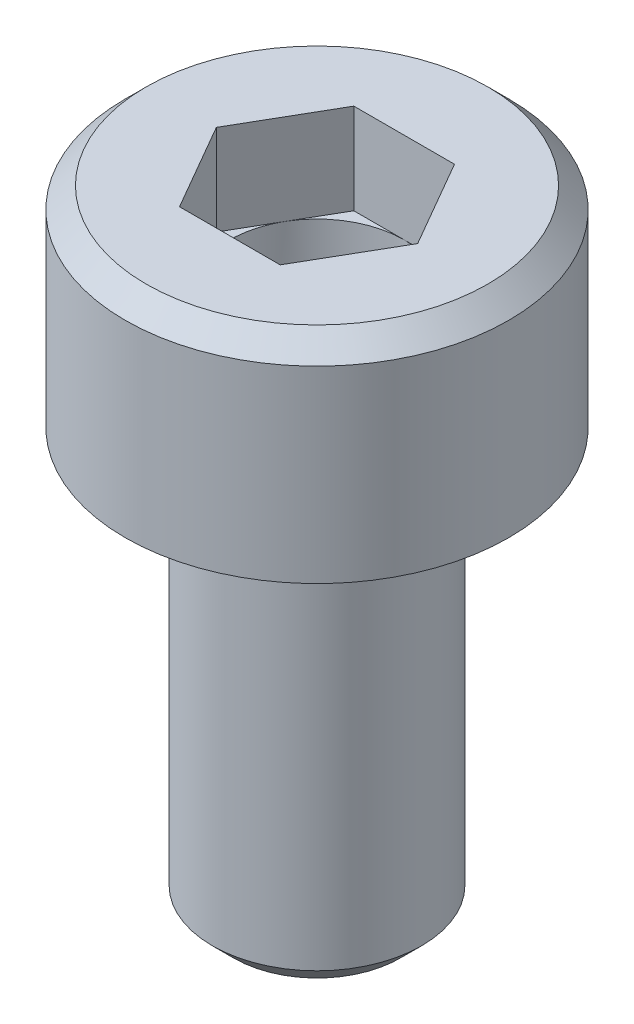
ISO-10303-21;
HEADER;
FILE_DESCRIPTION(('STEP AP214'),'2;1');
FILE_NAME('part.step','',(''),(''),'','','');
FILE_SCHEMA(('AUTOMOTIVE_DESIGN { 1 0 10303 214 1 1 1 1 }'));
ENDSEC;
DATA;
#1=APPLICATION_CONTEXT('core data for automotive mechanical design processes');
#2=APPLICATION_PROTOCOL_DEFINITION('international standard','automotive_design',2000,#1);
#3=PRODUCT_CONTEXT('',#1,'mechanical');
#4=PRODUCT('Part','Part','',(#3));
#5=PRODUCT_RELATED_PRODUCT_CATEGORY('part','',(#4));
#6=PRODUCT_DEFINITION_FORMATION('','',#4);
#7=PRODUCT_DEFINITION_CONTEXT('part definition',#1,'design');
#8=PRODUCT_DEFINITION('design','',#6,#7);
#9=PRODUCT_DEFINITION_SHAPE('','',#8);
#10=(LENGTH_UNIT() NAMED_UNIT(*) SI_UNIT(.MILLI.,.METRE.));
#11=(NAMED_UNIT(*) PLANE_ANGLE_UNIT() SI_UNIT($,.RADIAN.));
#12=(NAMED_UNIT(*) SI_UNIT($,.STERADIAN.) SOLID_ANGLE_UNIT());
#13=UNCERTAINTY_MEASURE_WITH_UNIT(LENGTH_MEASURE(1.E-05),#10,'distance_accuracy_value','');
#14=(GEOMETRIC_REPRESENTATION_CONTEXT(3) GLOBAL_UNCERTAINTY_ASSIGNED_CONTEXT((#13)) GLOBAL_UNIT_ASSIGNED_CONTEXT((#10,
#11,#12)) REPRESENTATION_CONTEXT('',''));
#15=CARTESIAN_POINT('',(0.,0.,0.));
#16=DIRECTION('',(0.,0.,1.));
#17=DIRECTION('',(1.,0.,0.));
#18=AXIS2_PLACEMENT_3D('',#15,#16,#17);
#19=CARTESIAN_POINT('',(0.,1.14999999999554,0.));
#20=DIRECTION('',(0.,1.,0.));
#21=DIRECTION('',(0.,0.,1.));
#22=AXIS2_PLACEMENT_3D('',#19,#20,#21);
#23=CONICAL_SURFACE('',#22,1.25000000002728,1.04719755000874);
#24=CARTESIAN_POINT('',(0.,0.428312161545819,-5.6843418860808E-11));
#25=VERTEX_POINT('',#24);
#26=VERTEX_LOOP('',#25);
#27=FACE_BOUND('',#26,.T.);
#28=CARTESIAN_POINT('',(0.,1.15,0.));
#29=DIRECTION('',(0.,-1.,0.));
#30=DIRECTION('',(0.,0.,-1.));
#31=AXIS2_PLACEMENT_3D('',#28,#29,#30);
#32=CIRCLE('',#31,1.25);
#33=CARTESIAN_POINT('',(0.,1.15,-1.25));
#34=VERTEX_POINT('',#33);
#35=EDGE_CURVE('E99',#34,#34,#32,.F.);
#36=ORIENTED_EDGE('',*,*,#35,.T.);
#37=EDGE_LOOP('',(#36));
#38=FACE_BOUND('',#37,.T.);
#39=ADVANCED_FACE('F17',(#27,#38),#23,.F.);
#40=CARTESIAN_POINT('',(0.,3.,0.));
#41=DIRECTION('',(0.,-1.,0.));
#42=DIRECTION('',(0.,0.,-1.));
#43=AXIS2_PLACEMENT_3D('',#40,#41,#42);
#44=CYLINDRICAL_SURFACE('',#43,1.25);
#45=CARTESIAN_POINT('',(0.,1.7,0.));
#46=DIRECTION('',(0.,-1.,0.));
#47=DIRECTION('',(0.,0.,-1.));
#48=AXIS2_PLACEMENT_3D('',#45,#46,#47);
#49=CIRCLE('',#48,1.25);
#50=CARTESIAN_POINT('',(0.,1.7,-1.25));
#51=VERTEX_POINT('',#50);
#52=CARTESIAN_POINT('',(-1.08253175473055,1.7,-0.625));
#53=VERTEX_POINT('',#52);
#54=EDGE_CURVE('E20',#51,#53,#49,.F.);
#55=ORIENTED_EDGE('',*,*,#54,.T.);
#56=CARTESIAN_POINT('',(0.,1.7,0.));
#57=DIRECTION('',(0.,-1.,0.));
#58=DIRECTION('',(0.,0.,-1.));
#59=AXIS2_PLACEMENT_3D('',#56,#57,#58);
#60=CIRCLE('',#59,1.25);
#61=CARTESIAN_POINT('',(-1.08253175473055,1.7,0.625));
#62=VERTEX_POINT('',#61);
#63=EDGE_CURVE('E94',#53,#62,#60,.F.);
#64=ORIENTED_EDGE('',*,*,#63,.T.);
#65=CARTESIAN_POINT('',(0.,1.7,0.));
#66=DIRECTION('',(0.,-1.,0.));
#67=DIRECTION('',(0.,0.,-1.));
#68=AXIS2_PLACEMENT_3D('',#65,#66,#67);
#69=CIRCLE('',#68,1.25);
#70=CARTESIAN_POINT('',(0.,1.7,1.25));
#71=VERTEX_POINT('',#70);
#72=EDGE_CURVE('E109',#62,#71,#69,.F.);
#73=ORIENTED_EDGE('',*,*,#72,.T.);
#74=CARTESIAN_POINT('',(0.,1.7,0.));
#75=DIRECTION('',(0.,-1.,0.));
#76=DIRECTION('',(0.,0.,-1.));
#77=AXIS2_PLACEMENT_3D('',#74,#75,#76);
#78=CIRCLE('',#77,1.25);
#79=CARTESIAN_POINT('',(1.08253175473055,1.7,0.625));
#80=VERTEX_POINT('',#79);
#81=EDGE_CURVE('E218',#71,#80,#78,.F.);
#82=ORIENTED_EDGE('',*,*,#81,.T.);
#83=CARTESIAN_POINT('',(0.,1.7,0.));
#84=DIRECTION('',(0.,-1.,0.));
#85=DIRECTION('',(0.,0.,-1.));
#86=AXIS2_PLACEMENT_3D('',#83,#84,#85);
#87=CIRCLE('',#86,1.25);
#88=CARTESIAN_POINT('',(1.08253175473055,1.7,-0.625));
#89=VERTEX_POINT('',#88);
#90=EDGE_CURVE('E220',#80,#89,#87,.F.);
#91=ORIENTED_EDGE('',*,*,#90,.T.);
#92=CARTESIAN_POINT('',(0.,1.7,0.));
#93=DIRECTION('',(0.,-1.,0.));
#94=DIRECTION('',(0.,0.,-1.));
#95=AXIS2_PLACEMENT_3D('',#92,#93,#94);
#96=CIRCLE('',#95,1.25);
#97=EDGE_CURVE('E89',#89,#51,#96,.F.);
#98=ORIENTED_EDGE('',*,*,#97,.T.);
#99=EDGE_LOOP('',(#55,#64,#73,#82,#91,#98));
#100=FACE_BOUND('',#99,.T.);
#101=ORIENTED_EDGE('',*,*,#35,.F.);
#102=EDGE_LOOP('',(#101));
#103=FACE_BOUND('',#102,.T.);
#104=ADVANCED_FACE('F92',(#100,#103),#44,.F.);
#105=CARTESIAN_POINT('',(0.,1.7,0.));
#106=DIRECTION('',(0.,-1.,0.));
#107=DIRECTION('',(0.,0.,-1.));
#108=AXIS2_PLACEMENT_3D('',#105,#106,#107);
#109=PLANE('',#108);
#110=DIRECTION('',(-0.5,0.,0.866025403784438));
#111=VECTOR('',#110,1.);
#112=CARTESIAN_POINT('',(-1.08253175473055,1.7,-0.625));
#113=LINE('',#112,#111);
#114=CARTESIAN_POINT('',(-0.721687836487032,1.7,-1.25));
#115=VERTEX_POINT('',#114);
#116=EDGE_CURVE('E112',#115,#53,#113,.T.);
#117=ORIENTED_EDGE('',*,*,#116,.T.);
#118=ORIENTED_EDGE('',*,*,#54,.F.);
#119=DIRECTION('',(-1.,0.,0.));
#120=VECTOR('',#119,1.);
#121=CARTESIAN_POINT('',(0.,1.7,-1.25));
#122=LINE('',#121,#120);
#123=EDGE_CURVE('E115',#51,#115,#122,.T.);
#124=ORIENTED_EDGE('',*,*,#123,.T.);
#125=EDGE_LOOP('',(#117,#118,#124));
#126=FACE_BOUND('',#125,.T.);
#127=ADVANCED_FACE('F113',(#126),#109,.F.);
#128=CARTESIAN_POINT('',(0.,1.7,0.));
#129=DIRECTION('',(0.,-1.,0.));
#130=DIRECTION('',(0.,0.,-1.));
#131=AXIS2_PLACEMENT_3D('',#128,#129,#130);
#132=PLANE('',#131);
#133=DIRECTION('',(-1.,0.,0.));
#134=VECTOR('',#133,1.);
#135=CARTESIAN_POINT('',(0.,1.7,-1.25));
#136=LINE('',#135,#134);
#137=CARTESIAN_POINT('',(0.721687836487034,1.7,-1.25));
#138=VERTEX_POINT('',#137);
#139=EDGE_CURVE('E184',#138,#51,#136,.T.);
#140=ORIENTED_EDGE('',*,*,#139,.T.);
#141=ORIENTED_EDGE('',*,*,#97,.F.);
#142=DIRECTION('',(0.5,0.,0.866025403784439));
#143=VECTOR('',#142,1.);
#144=CARTESIAN_POINT('',(1.08253175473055,1.7,-0.625));
#145=LINE('',#144,#143);
#146=EDGE_CURVE('E175',#138,#89,#145,.T.);
#147=ORIENTED_EDGE('',*,*,#146,.F.);
#148=EDGE_LOOP('',(#140,#141,#147));
#149=FACE_BOUND('',#148,.T.);
#150=ADVANCED_FACE('F227',(#149),#132,.F.);
#151=CARTESIAN_POINT('',(0.,1.7,0.));
#152=DIRECTION('',(0.,-1.,0.));
#153=DIRECTION('',(0.,0.,-1.));
#154=AXIS2_PLACEMENT_3D('',#151,#152,#153);
#155=PLANE('',#154);
#156=DIRECTION('',(0.5,0.,0.866025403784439));
#157=VECTOR('',#156,1.);
#158=CARTESIAN_POINT('',(1.08253175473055,1.7,-0.625));
#159=LINE('',#158,#157);
#160=CARTESIAN_POINT('',(1.44337567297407,1.7,0.));
#161=VERTEX_POINT('',#160);
#162=EDGE_CURVE('E172',#89,#161,#159,.T.);
#163=ORIENTED_EDGE('',*,*,#162,.F.);
#164=ORIENTED_EDGE('',*,*,#90,.F.);
#165=DIRECTION('',(-0.5,0.,0.866025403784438));
#166=VECTOR('',#165,1.);
#167=CARTESIAN_POINT('',(1.08253175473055,1.7,0.625));
#168=LINE('',#167,#166);
#169=EDGE_CURVE('E160',#161,#80,#168,.T.);
#170=ORIENTED_EDGE('',*,*,#169,.F.);
#171=EDGE_LOOP('',(#163,#164,#170));
#172=FACE_BOUND('',#171,.T.);
#173=ADVANCED_FACE('F229',(#172),#155,.F.);
#174=CARTESIAN_POINT('',(0.,1.7,0.));
#175=DIRECTION('',(0.,-1.,0.));
#176=DIRECTION('',(0.,0.,-1.));
#177=AXIS2_PLACEMENT_3D('',#174,#175,#176);
#178=PLANE('',#177);
#179=DIRECTION('',(-0.5,0.,0.866025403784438));
#180=VECTOR('',#179,1.);
#181=CARTESIAN_POINT('',(1.08253175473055,1.7,0.625));
#182=LINE('',#181,#180);
#183=CARTESIAN_POINT('',(0.721687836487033,1.7,1.25));
#184=VERTEX_POINT('',#183);
#185=EDGE_CURVE('E157',#80,#184,#182,.T.);
#186=ORIENTED_EDGE('',*,*,#185,.F.);
#187=ORIENTED_EDGE('',*,*,#81,.F.);
#188=DIRECTION('',(-1.,0.,0.));
#189=VECTOR('',#188,1.);
#190=CARTESIAN_POINT('',(0.,1.7,1.25));
#191=LINE('',#190,#189);
#192=EDGE_CURVE('E145',#184,#71,#191,.T.);
#193=ORIENTED_EDGE('',*,*,#192,.F.);
#194=EDGE_LOOP('',(#186,#187,#193));
#195=FACE_BOUND('',#194,.T.);
#196=ADVANCED_FACE('F266',(#195),#178,.F.);
#197=CARTESIAN_POINT('',(0.,1.7,0.));
#198=DIRECTION('',(0.,-1.,0.));
#199=DIRECTION('',(0.,0.,-1.));
#200=AXIS2_PLACEMENT_3D('',#197,#198,#199);
#201=PLANE('',#200);
#202=DIRECTION('',(-1.,0.,0.));
#203=VECTOR('',#202,1.);
#204=CARTESIAN_POINT('',(0.,1.7,1.25));
#205=LINE('',#204,#203);
#206=CARTESIAN_POINT('',(-0.721687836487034,1.7,1.25));
#207=VERTEX_POINT('',#206);
#208=EDGE_CURVE('E142',#71,#207,#205,.T.);
#209=ORIENTED_EDGE('',*,*,#208,.F.);
#210=ORIENTED_EDGE('',*,*,#72,.F.);
#211=DIRECTION('',(0.5,0.,0.866025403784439));
#212=VECTOR('',#211,1.);
#213=CARTESIAN_POINT('',(-1.08253175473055,1.7,0.625));
#214=LINE('',#213,#212);
#215=EDGE_CURVE('E149',#62,#207,#214,.T.);
#216=ORIENTED_EDGE('',*,*,#215,.T.);
#217=EDGE_LOOP('',(#209,#210,#216));
#218=FACE_BOUND('',#217,.T.);
#219=ADVANCED_FACE('F263',(#218),#201,.F.);
#220=CARTESIAN_POINT('',(0.,1.7,0.));
#221=DIRECTION('',(0.,-1.,0.));
#222=DIRECTION('',(0.,0.,-1.));
#223=AXIS2_PLACEMENT_3D('',#220,#221,#222);
#224=PLANE('',#223);
#225=DIRECTION('',(0.5,0.,0.866025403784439));
#226=VECTOR('',#225,1.);
#227=CARTESIAN_POINT('',(-1.08253175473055,1.7,0.625));
#228=LINE('',#227,#226);
#229=CARTESIAN_POINT('',(-1.44337567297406,1.7,0.));
#230=VERTEX_POINT('',#229);
#231=EDGE_CURVE('E107',#230,#62,#228,.T.);
#232=ORIENTED_EDGE('',*,*,#231,.T.);
#233=ORIENTED_EDGE('',*,*,#63,.F.);
#234=DIRECTION('',(-0.5,0.,0.866025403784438));
#235=VECTOR('',#234,1.);
#236=CARTESIAN_POINT('',(-1.08253175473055,1.7,-0.625));
#237=LINE('',#236,#235);
#238=EDGE_CURVE('E104',#53,#230,#237,.T.);
#239=ORIENTED_EDGE('',*,*,#238,.T.);
#240=EDGE_LOOP('',(#232,#233,#239));
#241=FACE_BOUND('',#240,.T.);
#242=ADVANCED_FACE('F102',(#241),#224,.F.);
#243=CARTESIAN_POINT('',(-1.08253175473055,2.5,-0.625));
#244=DIRECTION('',(-0.866025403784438,0.,-0.5));
#245=DIRECTION('',(-0.5,0.,0.866025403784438));
#246=AXIS2_PLACEMENT_3D('',#243,#244,#245);
#247=PLANE('',#246);
#248=DIRECTION('',(0.,1.,0.));
#249=VECTOR('',#248,1.);
#250=CARTESIAN_POINT('',(-0.721687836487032,3.,-1.25));
#251=LINE('',#250,#249);
#252=CARTESIAN_POINT('',(-0.721687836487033,3.,-1.25));
#253=VERTEX_POINT('',#252);
#254=EDGE_CURVE('E188',#115,#253,#251,.T.);
#255=ORIENTED_EDGE('',*,*,#254,.T.);
#256=DIRECTION('',(0.499999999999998,0.,-0.86602540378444));
#257=VECTOR('',#256,1.);
#258=CARTESIAN_POINT('',(-1.44337567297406,3.,0.));
#259=LINE('',#258,#257);
#260=CARTESIAN_POINT('',(-1.44337567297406,3.,0.));
#261=VERTEX_POINT('',#260);
#262=EDGE_CURVE('E129',#261,#253,#259,.T.);
#263=ORIENTED_EDGE('',*,*,#262,.F.);
#264=DIRECTION('',(0.,1.,0.));
#265=VECTOR('',#264,1.);
#266=CARTESIAN_POINT('',(-1.44337567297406,2.5,0.));
#267=LINE('',#266,#265);
#268=EDGE_CURVE('E121',#261,#230,#267,.F.);
#269=ORIENTED_EDGE('',*,*,#268,.T.);
#270=ORIENTED_EDGE('',*,*,#238,.F.);
#271=ORIENTED_EDGE('',*,*,#116,.F.);
#272=EDGE_LOOP('',(#255,#263,#269,#270,#271));
#273=FACE_BOUND('',#272,.T.);
#274=ADVANCED_FACE('F119',(#273),#247,.F.);
#275=CARTESIAN_POINT('',(0.,3.,-1.25));
#276=DIRECTION('',(0.,0.,-1.));
#277=DIRECTION('',(-1.,0.,0.));
#278=AXIS2_PLACEMENT_3D('',#275,#276,#277);
#279=PLANE('',#278);
#280=DIRECTION('',(0.,1.,0.));
#281=VECTOR('',#280,1.);
#282=CARTESIAN_POINT('',(0.721687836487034,2.5,-1.25));
#283=LINE('',#282,#281);
#284=CARTESIAN_POINT('',(0.721687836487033,3.,-1.25));
#285=VERTEX_POINT('',#284);
#286=EDGE_CURVE('E169',#285,#138,#283,.F.);
#287=ORIENTED_EDGE('',*,*,#286,.F.);
#288=DIRECTION('',(1.,0.,0.));
#289=VECTOR('',#288,1.);
#290=CARTESIAN_POINT('',(0.,3.,-1.25));
#291=LINE('',#290,#289);
#292=EDGE_CURVE('E132',#253,#285,#291,.T.);
#293=ORIENTED_EDGE('',*,*,#292,.F.);
#294=ORIENTED_EDGE('',*,*,#254,.F.);
#295=ORIENTED_EDGE('',*,*,#123,.F.);
#296=ORIENTED_EDGE('',*,*,#139,.F.);
#297=EDGE_LOOP('',(#287,#293,#294,#295,#296));
#298=FACE_BOUND('',#297,.T.);
#299=ADVANCED_FACE('F238',(#298),#279,.F.);
#300=CARTESIAN_POINT('',(1.08253175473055,2.5,-0.625));
#301=DIRECTION('',(-0.866025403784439,0.,0.5));
#302=DIRECTION('',(0.5,0.,0.866025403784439));
#303=AXIS2_PLACEMENT_3D('',#300,#301,#302);
#304=PLANE('',#303);
#305=DIRECTION('',(0.499999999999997,0.,0.86602540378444));
#306=VECTOR('',#305,1.);
#307=CARTESIAN_POINT('',(0.721687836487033,3.,-1.25));
#308=LINE('',#307,#306);
#309=CARTESIAN_POINT('',(1.44337567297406,3.,0.));
#310=VERTEX_POINT('',#309);
#311=EDGE_CURVE('E234',#285,#310,#308,.T.);
#312=ORIENTED_EDGE('',*,*,#311,.F.);
#313=ORIENTED_EDGE('',*,*,#286,.T.);
#314=ORIENTED_EDGE('',*,*,#146,.T.);
#315=ORIENTED_EDGE('',*,*,#162,.T.);
#316=DIRECTION('',(0.,1.,0.));
#317=VECTOR('',#316,1.);
#318=CARTESIAN_POINT('',(1.44337567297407,2.5,0.));
#319=LINE('',#318,#317);
#320=EDGE_CURVE('E154',#310,#161,#319,.F.);
#321=ORIENTED_EDGE('',*,*,#320,.F.);
#322=EDGE_LOOP('',(#312,#313,#314,#315,#321));
#323=FACE_BOUND('',#322,.T.);
#324=ADVANCED_FACE('F232',(#323),#304,.T.);
#325=CARTESIAN_POINT('',(1.08253175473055,2.5,0.625));
#326=DIRECTION('',(-0.866025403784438,0.,-0.5));
#327=DIRECTION('',(-0.5,0.,0.866025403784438));
#328=AXIS2_PLACEMENT_3D('',#325,#326,#327);
#329=PLANE('',#328);
#330=DIRECTION('',(-0.499999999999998,0.,0.86602540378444));
#331=VECTOR('',#330,1.);
#332=CARTESIAN_POINT('',(1.44337567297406,3.,0.));
#333=LINE('',#332,#331);
#334=CARTESIAN_POINT('',(0.721687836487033,3.,1.25));
#335=VERTEX_POINT('',#334);
#336=EDGE_CURVE('E247',#310,#335,#333,.T.);
#337=ORIENTED_EDGE('',*,*,#336,.F.);
#338=ORIENTED_EDGE('',*,*,#320,.T.);
#339=ORIENTED_EDGE('',*,*,#169,.T.);
#340=ORIENTED_EDGE('',*,*,#185,.T.);
#341=DIRECTION('',(0.,1.,0.));
#342=VECTOR('',#341,1.);
#343=CARTESIAN_POINT('',(0.721687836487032,3.,1.25));
#344=LINE('',#343,#342);
#345=EDGE_CURVE('E144',#335,#184,#344,.F.);
#346=ORIENTED_EDGE('',*,*,#345,.F.);
#347=EDGE_LOOP('',(#337,#338,#339,#340,#346));
#348=FACE_BOUND('',#347,.T.);
#349=ADVANCED_FACE('F268',(#348),#329,.T.);
#350=CARTESIAN_POINT('',(0.,3.,1.25));
#351=DIRECTION('',(0.,0.,-1.));
#352=DIRECTION('',(-1.,0.,0.));
#353=AXIS2_PLACEMENT_3D('',#350,#351,#352);
#354=PLANE('',#353);
#355=DIRECTION('',(1.,0.,0.));
#356=VECTOR('',#355,1.);
#357=CARTESIAN_POINT('',(0.,3.,1.25));
#358=LINE('',#357,#356);
#359=CARTESIAN_POINT('',(-0.721687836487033,3.,1.25));
#360=VERTEX_POINT('',#359);
#361=EDGE_CURVE('E139',#335,#360,#358,.F.);
#362=ORIENTED_EDGE('',*,*,#361,.F.);
#363=ORIENTED_EDGE('',*,*,#345,.T.);
#364=ORIENTED_EDGE('',*,*,#192,.T.);
#365=ORIENTED_EDGE('',*,*,#208,.T.);
#366=DIRECTION('',(0.,1.,0.));
#367=VECTOR('',#366,1.);
#368=CARTESIAN_POINT('',(-0.721687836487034,2.5,1.25));
#369=LINE('',#368,#367);
#370=EDGE_CURVE('E35',#207,#360,#369,.T.);
#371=ORIENTED_EDGE('',*,*,#370,.T.);
#372=EDGE_LOOP('',(#362,#363,#364,#365,#371));
#373=FACE_BOUND('',#372,.T.);
#374=ADVANCED_FACE('F264',(#373),#354,.T.);
#375=CARTESIAN_POINT('',(-1.08253175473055,2.5,0.625));
#376=DIRECTION('',(-0.866025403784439,0.,0.5));
#377=DIRECTION('',(0.5,0.,0.866025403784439));
#378=AXIS2_PLACEMENT_3D('',#375,#376,#377);
#379=PLANE('',#378);
#380=ORIENTED_EDGE('',*,*,#268,.F.);
#381=DIRECTION('',(-0.499999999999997,0.,-0.86602540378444));
#382=VECTOR('',#381,1.);
#383=CARTESIAN_POINT('',(-0.721687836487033,3.,1.25));
#384=LINE('',#383,#382);
#385=EDGE_CURVE('E135',#360,#261,#384,.T.);
#386=ORIENTED_EDGE('',*,*,#385,.F.);
#387=ORIENTED_EDGE('',*,*,#370,.F.);
#388=ORIENTED_EDGE('',*,*,#215,.F.);
#389=ORIENTED_EDGE('',*,*,#231,.F.);
#390=EDGE_LOOP('',(#380,#386,#387,#388,#389));
#391=FACE_BOUND('',#390,.T.);
#392=ADVANCED_FACE('F241',(#391),#379,.F.);
#393=CARTESIAN_POINT('',(0.,3.,0.));
#394=DIRECTION('',(0.,1.,0.));
#395=DIRECTION('',(0.,0.,1.));
#396=AXIS2_PLACEMENT_3D('',#393,#394,#395);
#397=PLANE('',#396);
#398=ORIENTED_EDGE('',*,*,#361,.T.);
#399=ORIENTED_EDGE('',*,*,#385,.T.);
#400=ORIENTED_EDGE('',*,*,#262,.T.);
#401=ORIENTED_EDGE('',*,*,#292,.T.);
#402=ORIENTED_EDGE('',*,*,#311,.T.);
#403=ORIENTED_EDGE('',*,*,#336,.T.);
#404=EDGE_LOOP('',(#398,#399,#400,#401,#402,#403));
#405=FACE_BOUND('',#404,.T.);
#406=CARTESIAN_POINT('',(0.,3.00000000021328,0.));
#407=DIRECTION('',(0.,-1.,0.));
#408=DIRECTION('',(0.,0.,-1.));
#409=AXIS2_PLACEMENT_3D('',#406,#407,#408);
#410=CIRCLE('',#409,2.45000000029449);
#411=CARTESIAN_POINT('',(0.,3.00000000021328,-2.45000000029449));
#412=VERTEX_POINT('',#411);
#413=EDGE_CURVE('E138',#412,#412,#410,.T.);
#414=ORIENTED_EDGE('',*,*,#413,.F.);
#415=EDGE_LOOP('',(#414));
#416=FACE_BOUND('',#415,.T.);
#417=ADVANCED_FACE('F243',(#405,#416),#397,.T.);
#418=CARTESIAN_POINT('',(0.,2.69999999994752,0.));
#419=DIRECTION('',(0.,-1.,0.));
#420=DIRECTION('',(0.,0.,-1.));
#421=AXIS2_PLACEMENT_3D('',#418,#419,#420);
#422=CONICAL_SURFACE('',#421,2.74999999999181,0.785398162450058);
#423=CARTESIAN_POINT('',(0.,2.7,0.));
#424=DIRECTION('',(0.,1.,0.));
#425=DIRECTION('',(0.,0.,1.));
#426=AXIS2_PLACEMENT_3D('',#423,#424,#425);
#427=CIRCLE('',#426,2.75);
#428=CARTESIAN_POINT('',(0.,2.7,2.75));
#429=VERTEX_POINT('',#428);
#430=EDGE_CURVE('E214',#429,#429,#427,.F.);
#431=ORIENTED_EDGE('',*,*,#430,.F.);
#432=EDGE_LOOP('',(#431));
#433=FACE_BOUND('',#432,.T.);
#434=ORIENTED_EDGE('',*,*,#413,.T.);
#435=EDGE_LOOP('',(#434));
#436=FACE_BOUND('',#435,.T.);
#437=ADVANCED_FACE('F324',(#433,#436),#422,.T.);
#438=CARTESIAN_POINT('',(0.,0.,0.));
#439=DIRECTION('',(0.,1.,0.));
#440=DIRECTION('',(0.,0.,1.));
#441=AXIS2_PLACEMENT_3D('',#438,#439,#440);
#442=CYLINDRICAL_SURFACE('',#441,2.75);
#443=CARTESIAN_POINT('',(0.,0.,0.));
#444=DIRECTION('',(0.,1.,0.));
#445=DIRECTION('',(0.,0.,1.));
#446=AXIS2_PLACEMENT_3D('',#443,#444,#445);
#447=CIRCLE('',#446,2.75);
#448=CARTESIAN_POINT('',(0.,0.,2.75));
#449=VERTEX_POINT('',#448);
#450=EDGE_CURVE('E211',#449,#449,#447,.F.);
#451=ORIENTED_EDGE('',*,*,#450,.F.);
#452=EDGE_LOOP('',(#451));
#453=FACE_BOUND('',#452,.T.);
#454=ORIENTED_EDGE('',*,*,#430,.T.);
#455=EDGE_LOOP('',(#454));
#456=FACE_BOUND('',#455,.T.);
#457=ADVANCED_FACE('F320',(#453,#456),#442,.T.);
#458=CARTESIAN_POINT('',(0.,-6.,0.));
#459=DIRECTION('',(0.,-1.,0.));
#460=DIRECTION('',(0.,0.,-1.));
#461=AXIS2_PLACEMENT_3D('',#458,#459,#460);
#462=PLANE('',#461);
#463=CARTESIAN_POINT('',(0.,-5.99999999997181,0.));
#464=DIRECTION('',(0.,1.,0.));
#465=DIRECTION('',(0.,0.,1.));
#466=AXIS2_PLACEMENT_3D('',#463,#464,#465);
#467=CIRCLE('',#466,1.19327499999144);
#468=CARTESIAN_POINT('',(0.,-5.99999999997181,1.19327499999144));
#469=VERTEX_POINT('',#468);
#470=EDGE_CURVE('E207',#469,#469,#467,.T.);
#471=ORIENTED_EDGE('',*,*,#470,.F.);
#472=EDGE_LOOP('',(#471));
#473=FACE_BOUND('',#472,.T.);
#474=ADVANCED_FACE('F316',(#473),#462,.T.);
#475=CARTESIAN_POINT('',(0.,0.,0.));
#476=DIRECTION('',(0.,-1.,0.));
#477=DIRECTION('',(0.,0.,-1.));
#478=AXIS2_PLACEMENT_3D('',#475,#476,#477);
#479=PLANE('',#478);
#480=ORIENTED_EDGE('',*,*,#450,.T.);
#481=EDGE_LOOP('',(#480));
#482=FACE_BOUND('',#481,.T.);
#483=CARTESIAN_POINT('',(0.,0.,0.));
#484=DIRECTION('',(0.,-1.,0.));
#485=DIRECTION('',(0.,0.,-1.));
#486=AXIS2_PLACEMENT_3D('',#483,#484,#485);
#487=CIRCLE('',#486,1.6);
#488=CARTESIAN_POINT('',(0.,0.,-1.6));
#489=VERTEX_POINT('',#488);
#490=EDGE_CURVE('E210',#489,#489,#487,.F.);
#491=ORIENTED_EDGE('',*,*,#490,.T.);
#492=EDGE_LOOP('',(#491));
#493=FACE_BOUND('',#492,.T.);
#494=ADVANCED_FACE('F307',(#482,#493),#479,.T.);
#495=CARTESIAN_POINT('',(0.,-5.69327499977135,0.));
#496=DIRECTION('',(0.,1.,0.));
#497=DIRECTION('',(0.,0.,1.));
#498=AXIS2_PLACEMENT_3D('',#495,#496,#497);
#499=CONICAL_SURFACE('',#498,1.49999999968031,0.785398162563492);
#500=ORIENTED_EDGE('',*,*,#470,.T.);
#501=EDGE_LOOP('',(#500));
#502=FACE_BOUND('',#501,.T.);
#503=CARTESIAN_POINT('',(0.,-5.693275,0.));
#504=DIRECTION('',(0.,-1.,0.));
#505=DIRECTION('',(0.,0.,-1.));
#506=AXIS2_PLACEMENT_3D('',#503,#504,#505);
#507=CIRCLE('',#506,1.5);
#508=CARTESIAN_POINT('',(0.,-5.693275,-1.5));
#509=VERTEX_POINT('',#508);
#510=EDGE_CURVE('E26',#509,#509,#507,.F.);
#511=ORIENTED_EDGE('',*,*,#510,.F.);
#512=EDGE_LOOP('',(#511));
#513=FACE_BOUND('',#512,.T.);
#514=ADVANCED_FACE('F286',(#502,#513),#499,.T.);
#515=CARTESIAN_POINT('',(0.,-0.1,0.));
#516=DIRECTION('',(0.,-1.,0.));
#517=DIRECTION('',(0.,0.,1.));
#518=AXIS2_PLACEMENT_3D('',#515,#516,#517);
#519=TOROIDAL_SURFACE('',#518,1.6,0.1);
#520=CARTESIAN_POINT('',(0.,-0.1,0.));
#521=DIRECTION('',(0.,-1.,0.));
#522=DIRECTION('',(0.,0.,-1.));
#523=AXIS2_PLACEMENT_3D('',#520,#521,#522);
#524=CIRCLE('',#523,1.5);
#525=CARTESIAN_POINT('',(0.,-0.1,-1.5));
#526=VERTEX_POINT('',#525);
#527=EDGE_CURVE('E11',#526,#526,#524,.T.);
#528=ORIENTED_EDGE('',*,*,#527,.F.);
#529=EDGE_LOOP('',(#528));
#530=FACE_BOUND('',#529,.T.);
#531=ORIENTED_EDGE('',*,*,#490,.F.);
#532=EDGE_LOOP('',(#531));
#533=FACE_BOUND('',#532,.T.);
#534=ADVANCED_FACE('F280',(#530,#533),#519,.F.);
#535=CARTESIAN_POINT('',(0.,0.,0.));
#536=DIRECTION('',(0.,-1.,0.));
#537=DIRECTION('',(0.,0.,-1.));
#538=AXIS2_PLACEMENT_3D('',#535,#536,#537);
#539=CYLINDRICAL_SURFACE('',#538,1.5);
#540=ORIENTED_EDGE('',*,*,#527,.T.);
#541=EDGE_LOOP('',(#540));
#542=FACE_BOUND('',#541,.T.);
#543=ORIENTED_EDGE('',*,*,#510,.T.);
#544=EDGE_LOOP('',(#543));
#545=FACE_BOUND('',#544,.T.);
#546=ADVANCED_FACE('F278',(#542,#545),#539,.T.);
#547=CLOSED_SHELL('',(#39,#104,#127,#150,#173,#196,#219,#242,#274,#299,#324,#349,#374,#392,#417,
#437,#457,#474,#494,#514,#534,#546));
#548=MANIFOLD_SOLID_BREP('B1',#547);
#549=ADVANCED_BREP_SHAPE_REPRESENTATION('',(#18,#548),#14);
#550=SHAPE_DEFINITION_REPRESENTATION(#9,#549);
ENDSEC;
END-ISO-10303-21;
